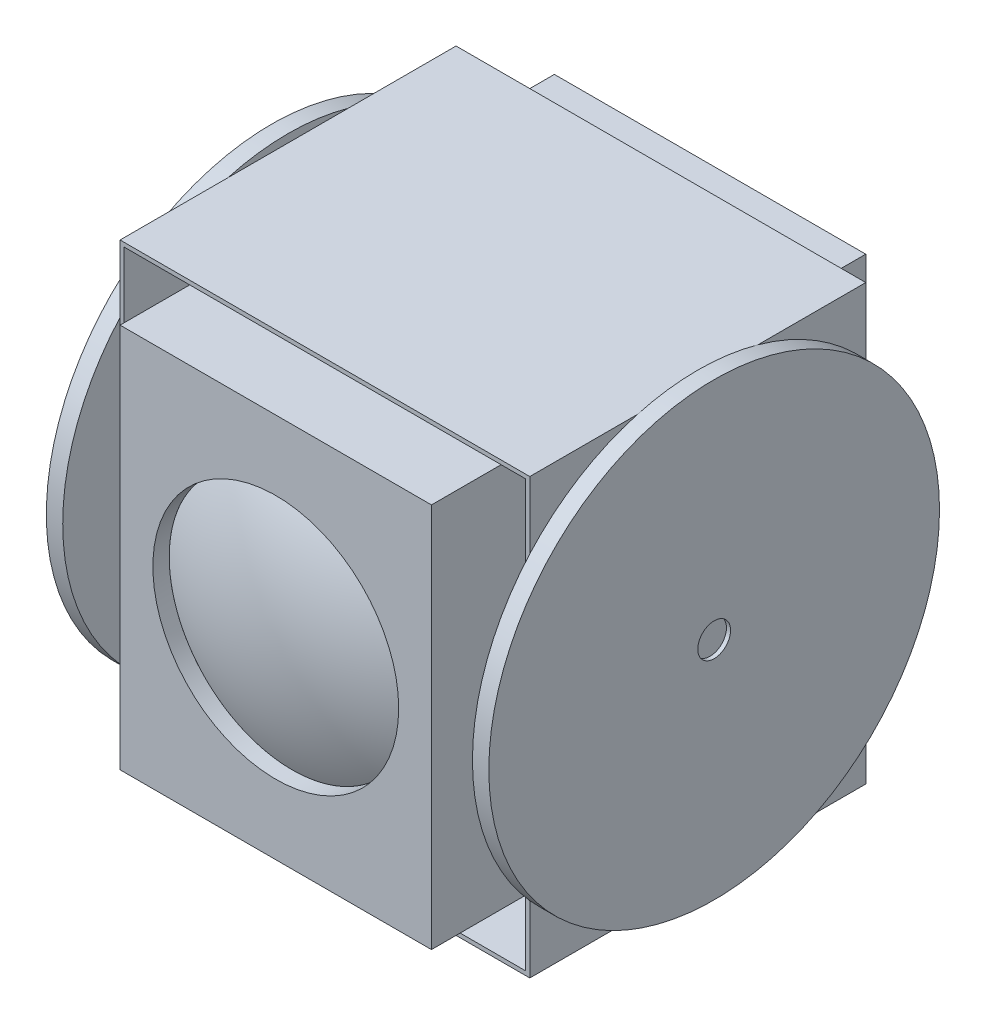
ISO-10303-21;
HEADER;
FILE_DESCRIPTION(('STEP AP214'),'2;1');
FILE_NAME('part.step','',(''),(''),'','','');
FILE_SCHEMA(('AUTOMOTIVE_DESIGN { 1 0 10303 214 1 1 1 1 }'));
ENDSEC;
DATA;
#1=APPLICATION_CONTEXT('core data for automotive mechanical design processes');
#2=APPLICATION_PROTOCOL_DEFINITION('international standard','automotive_design',2000,#1);
#3=PRODUCT_CONTEXT('',#1,'mechanical');
#4=PRODUCT('Part','Part','',(#3));
#5=PRODUCT_RELATED_PRODUCT_CATEGORY('part','',(#4));
#6=PRODUCT_DEFINITION_FORMATION('','',#4);
#7=PRODUCT_DEFINITION_CONTEXT('part definition',#1,'design');
#8=PRODUCT_DEFINITION('design','',#6,#7);
#9=PRODUCT_DEFINITION_SHAPE('','',#8);
#10=(LENGTH_UNIT() NAMED_UNIT(*) SI_UNIT(.MILLI.,.METRE.));
#11=(NAMED_UNIT(*) PLANE_ANGLE_UNIT() SI_UNIT($,.RADIAN.));
#12=(NAMED_UNIT(*) SI_UNIT($,.STERADIAN.) SOLID_ANGLE_UNIT());
#13=UNCERTAINTY_MEASURE_WITH_UNIT(LENGTH_MEASURE(1.E-05),#10,'distance_accuracy_value','');
#14=(GEOMETRIC_REPRESENTATION_CONTEXT(3) GLOBAL_UNCERTAINTY_ASSIGNED_CONTEXT((#13)) GLOBAL_UNIT_ASSIGNED_CONTEXT((#10,
#11,#12)) REPRESENTATION_CONTEXT('',''));
#15=CARTESIAN_POINT('',(0.,0.,0.));
#16=DIRECTION('',(0.,0.,1.));
#17=DIRECTION('',(1.,0.,0.));
#18=AXIS2_PLACEMENT_3D('',#15,#16,#17);
#19=CARTESIAN_POINT('',(-31.75,0.,31.115));
#20=DIRECTION('',(0.,0.,1.));
#21=DIRECTION('',(1.,0.,0.));
#22=AXIS2_PLACEMENT_3D('',#19,#20,#21);
#23=PLANE('',#22);
#24=CARTESIAN_POINT('',(-31.75,0.,31.115));
#25=DIRECTION('',(0.,0.,1.));
#26=DIRECTION('',(1.,0.,0.));
#27=AXIS2_PLACEMENT_3D('',#24,#25,#26);
#28=CIRCLE('',#27,19.05);
#29=CARTESIAN_POINT('',(-12.7,0.,31.115));
#30=VERTEX_POINT('',#29);
#31=EDGE_CURVE('E103',#30,#30,#28,.T.);
#32=ORIENTED_EDGE('',*,*,#31,.T.);
#33=EDGE_LOOP('',(#32));
#34=FACE_BOUND('',#33,.T.);
#35=CARTESIAN_POINT('',(-31.75,0.,31.115));
#36=DIRECTION('',(0.,0.,-1.));
#37=DIRECTION('',(-1.,0.,0.));
#38=AXIS2_PLACEMENT_3D('',#35,#36,#37);
#39=CIRCLE('',#38,19.0465448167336);
#40=CARTESIAN_POINT('',(-50.7965448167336,0.,31.1149999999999));
#41=VERTEX_POINT('',#40);
#42=EDGE_CURVE('E207',#41,#41,#39,.T.);
#43=ORIENTED_EDGE('',*,*,#42,.T.);
#44=EDGE_LOOP('',(#43));
#45=FACE_BOUND('',#44,.T.);
#46=ADVANCED_FACE('F45',(#34,#45),#23,.T.);
#47=CARTESIAN_POINT('',(-55.88,29.845,-118.033867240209));
#48=DIRECTION('',(-1.,0.,0.));
#49=DIRECTION('',(0.,-1.,0.));
#50=AXIS2_PLACEMENT_3D('',#47,#48,#49);
#51=PLANE('',#50);
#52=DIRECTION('',(0.,1.,0.));
#53=VECTOR('',#52,1.);
#54=CARTESIAN_POINT('',(-55.88,29.845,-33.655));
#55=LINE('',#54,#53);
#56=CARTESIAN_POINT('',(-55.88,-29.845,-33.655));
#57=VERTEX_POINT('',#56);
#58=CARTESIAN_POINT('',(-55.88,29.845,-33.655));
#59=VERTEX_POINT('',#58);
#60=EDGE_CURVE('E54',#57,#59,#55,.T.);
#61=ORIENTED_EDGE('',*,*,#60,.F.);
#62=DIRECTION('',(0.,0.,1.));
#63=VECTOR('',#62,1.);
#64=CARTESIAN_POINT('',(-55.88,-29.845,-118.033867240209));
#65=LINE('',#64,#63);
#66=CARTESIAN_POINT('',(-55.88,-29.845,33.655));
#67=VERTEX_POINT('',#66);
#68=EDGE_CURVE('E82',#57,#67,#65,.T.);
#69=ORIENTED_EDGE('',*,*,#68,.T.);
#70=DIRECTION('',(0.,-1.,0.));
#71=VECTOR('',#70,1.);
#72=CARTESIAN_POINT('',(-55.88,29.845,33.655));
#73=LINE('',#72,#71);
#74=CARTESIAN_POINT('',(-55.88,29.845,33.655));
#75=VERTEX_POINT('',#74);
#76=EDGE_CURVE('E86',#75,#67,#73,.T.);
#77=ORIENTED_EDGE('',*,*,#76,.F.);
#78=DIRECTION('',(0.,0.,1.));
#79=VECTOR('',#78,1.);
#80=CARTESIAN_POINT('',(-55.88,29.845,-118.033867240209));
#81=LINE('',#80,#79);
#82=EDGE_CURVE('E114',#59,#75,#81,.T.);
#83=ORIENTED_EDGE('',*,*,#82,.F.);
#84=EDGE_LOOP('',(#61,#69,#77,#83));
#85=FACE_BOUND('',#84,.T.);
#86=ADVANCED_FACE('F47',(#85),#51,.T.);
#87=CARTESIAN_POINT('',(-55.88,29.845,-118.033867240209));
#88=DIRECTION('',(0.,1.,0.));
#89=DIRECTION('',(0.,0.,1.));
#90=AXIS2_PLACEMENT_3D('',#87,#88,#89);
#91=PLANE('',#90);
#92=DIRECTION('',(1.,0.,0.));
#93=VECTOR('',#92,1.);
#94=CARTESIAN_POINT('',(-55.88,29.845,-33.655));
#95=LINE('',#94,#93);
#96=CARTESIAN_POINT('',(-7.62,29.845,-33.655));
#97=VERTEX_POINT('',#96);
#98=EDGE_CURVE('E60',#59,#97,#95,.T.);
#99=ORIENTED_EDGE('',*,*,#98,.F.);
#100=ORIENTED_EDGE('',*,*,#82,.T.);
#101=DIRECTION('',(-1.,0.,0.));
#102=VECTOR('',#101,1.);
#103=CARTESIAN_POINT('',(-55.88,29.845,33.655));
#104=LINE('',#103,#102);
#105=CARTESIAN_POINT('',(-7.62,29.845,33.655));
#106=VERTEX_POINT('',#105);
#107=EDGE_CURVE('E90',#106,#75,#104,.T.);
#108=ORIENTED_EDGE('',*,*,#107,.F.);
#109=DIRECTION('',(0.,0.,1.));
#110=VECTOR('',#109,1.);
#111=CARTESIAN_POINT('',(-7.62,29.845,-118.033867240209));
#112=LINE('',#111,#110);
#113=EDGE_CURVE('E118',#97,#106,#112,.T.);
#114=ORIENTED_EDGE('',*,*,#113,.F.);
#115=EDGE_LOOP('',(#99,#100,#108,#114));
#116=FACE_BOUND('',#115,.T.);
#117=ADVANCED_FACE('F124',(#116),#91,.T.);
#118=CARTESIAN_POINT('',(-7.62,29.845,-118.033867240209));
#119=DIRECTION('',(1.,0.,0.));
#120=DIRECTION('',(0.,1.,0.));
#121=AXIS2_PLACEMENT_3D('',#118,#119,#120);
#122=PLANE('',#121);
#123=DIRECTION('',(0.,-1.,0.));
#124=VECTOR('',#123,1.);
#125=CARTESIAN_POINT('',(-7.62,29.845,-33.655));
#126=LINE('',#125,#124);
#127=CARTESIAN_POINT('',(-7.61999999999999,-29.845,-33.655));
#128=VERTEX_POINT('',#127);
#129=EDGE_CURVE('E112',#97,#128,#126,.T.);
#130=ORIENTED_EDGE('',*,*,#129,.F.);
#131=ORIENTED_EDGE('',*,*,#113,.T.);
#132=DIRECTION('',(0.,1.,0.));
#133=VECTOR('',#132,1.);
#134=CARTESIAN_POINT('',(-7.62,29.845,33.655));
#135=LINE('',#134,#133);
#136=CARTESIAN_POINT('',(-7.61999999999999,-29.845,33.655));
#137=VERTEX_POINT('',#136);
#138=EDGE_CURVE('E98',#137,#106,#135,.T.);
#139=ORIENTED_EDGE('',*,*,#138,.F.);
#140=DIRECTION('',(0.,0.,1.));
#141=VECTOR('',#140,1.);
#142=CARTESIAN_POINT('',(-7.61999999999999,-29.845,-118.033867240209));
#143=LINE('',#142,#141);
#144=EDGE_CURVE('E89',#128,#137,#143,.T.);
#145=ORIENTED_EDGE('',*,*,#144,.F.);
#146=EDGE_LOOP('',(#130,#131,#139,#145));
#147=FACE_BOUND('',#146,.T.);
#148=ADVANCED_FACE('F122',(#147),#122,.T.);
#149=CARTESIAN_POINT('',(-55.88,-29.845,-118.033867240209));
#150=DIRECTION('',(0.,-1.,0.));
#151=DIRECTION('',(0.,0.,-1.));
#152=AXIS2_PLACEMENT_3D('',#149,#150,#151);
#153=PLANE('',#152);
#154=DIRECTION('',(-1.,0.,0.));
#155=VECTOR('',#154,1.);
#156=CARTESIAN_POINT('',(-55.88,-29.845,-33.655));
#157=LINE('',#156,#155);
#158=EDGE_CURVE('E12',#128,#57,#157,.T.);
#159=ORIENTED_EDGE('',*,*,#158,.F.);
#160=ORIENTED_EDGE('',*,*,#144,.T.);
#161=DIRECTION('',(1.,0.,0.));
#162=VECTOR('',#161,1.);
#163=CARTESIAN_POINT('',(-55.88,-29.845,33.655));
#164=LINE('',#163,#162);
#165=EDGE_CURVE('E92',#67,#137,#164,.T.);
#166=ORIENTED_EDGE('',*,*,#165,.F.);
#167=ORIENTED_EDGE('',*,*,#68,.F.);
#168=EDGE_LOOP('',(#159,#160,#166,#167));
#169=FACE_BOUND('',#168,.T.);
#170=ADVANCED_FACE('F93',(#169),#153,.T.);
#171=CARTESIAN_POINT('',(0.,33.655,-33.655));
#172=DIRECTION('',(0.,0.,1.));
#173=DIRECTION('',(1.,0.,0.));
#174=AXIS2_PLACEMENT_3D('',#171,#172,#173);
#175=PLANE('',#174);
#176=ORIENTED_EDGE('',*,*,#60,.T.);
#177=ORIENTED_EDGE('',*,*,#98,.T.);
#178=ORIENTED_EDGE('',*,*,#129,.T.);
#179=ORIENTED_EDGE('',*,*,#158,.T.);
#180=EDGE_LOOP('',(#176,#177,#178,#179));
#181=FACE_BOUND('',#180,.T.);
#182=ADVANCED_FACE('F147',(#181),#175,.F.);
#183=CARTESIAN_POINT('',(0.,0.,33.655));
#184=DIRECTION('',(0.,0.,1.));
#185=DIRECTION('',(1.,0.,0.));
#186=AXIS2_PLACEMENT_3D('',#183,#184,#185);
#187=PLANE('',#186);
#188=CARTESIAN_POINT('',(-31.75,0.,33.655));
#189=DIRECTION('',(0.,0.,1.));
#190=DIRECTION('',(1.,0.,0.));
#191=AXIS2_PLACEMENT_3D('',#188,#189,#190);
#192=CIRCLE('',#191,19.05);
#193=CARTESIAN_POINT('',(-12.7,0.,33.655));
#194=VERTEX_POINT('',#193);
#195=EDGE_CURVE('E106',#194,#194,#192,.T.);
#196=ORIENTED_EDGE('',*,*,#195,.F.);
#197=EDGE_LOOP('',(#196));
#198=FACE_BOUND('',#197,.T.);
#199=ORIENTED_EDGE('',*,*,#76,.T.);
#200=ORIENTED_EDGE('',*,*,#165,.T.);
#201=ORIENTED_EDGE('',*,*,#138,.T.);
#202=ORIENTED_EDGE('',*,*,#107,.T.);
#203=EDGE_LOOP('',(#199,#200,#201,#202));
#204=FACE_BOUND('',#203,.T.);
#205=ADVANCED_FACE('F101',(#198,#204),#187,.T.);
#206=CARTESIAN_POINT('',(-31.75,0.,31.115));
#207=DIRECTION('',(0.,0.,1.));
#208=DIRECTION('',(1.,0.,0.));
#209=AXIS2_PLACEMENT_3D('',#206,#207,#208);
#210=CYLINDRICAL_SURFACE('',#209,19.05);
#211=ORIENTED_EDGE('',*,*,#31,.F.);
#212=EDGE_LOOP('',(#211));
#213=FACE_BOUND('',#212,.T.);
#214=ORIENTED_EDGE('',*,*,#195,.T.);
#215=EDGE_LOOP('',(#214));
#216=FACE_BOUND('',#215,.T.);
#217=ADVANCED_FACE('F142',(#213,#216),#210,.F.);
#218=CARTESIAN_POINT('',(-31.75,0.,-7.63731000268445));
#219=DIRECTION('',(0.,0.,-1.));
#220=DIRECTION('',(1.,0.,0.));
#221=AXIS2_PLACEMENT_3D('',#218,#219,#220);
#222=SPHERICAL_SURFACE('',#221,43.18);
#223=ORIENTED_EDGE('',*,*,#42,.F.);
#224=EDGE_LOOP('',(#223));
#225=FACE_BOUND('',#224,.T.);
#226=ADVANCED_FACE('F141',(#225),#222,.T.);
#227=CLOSED_SHELL('',(#46,#86,#117,#148,#170,#182,#205,#217,#226));
#228=MANIFOLD_SOLID_BREP('B2',#227);
#229=CARTESIAN_POINT('',(0.,33.02,0.));
#230=DIRECTION('',(0.,1.,0.));
#231=DIRECTION('',(0.,0.,1.));
#232=AXIS2_PLACEMENT_3D('',#229,#230,#231);
#233=PLANE('',#232);
#234=DIRECTION('',(0.,0.,1.));
#235=VECTOR('',#234,1.);
#236=CARTESIAN_POINT('',(-62.865,33.02,-26.035));
#237=LINE('',#236,#235);
#238=CARTESIAN_POINT('',(-62.865,33.02,-26.035));
#239=VERTEX_POINT('',#238);
#240=CARTESIAN_POINT('',(-62.865,33.02,26.035));
#241=VERTEX_POINT('',#240);
#242=EDGE_CURVE('E234',#239,#241,#237,.T.);
#243=ORIENTED_EDGE('',*,*,#242,.F.);
#244=DIRECTION('',(-1.,0.,0.));
#245=VECTOR('',#244,1.);
#246=CARTESIAN_POINT('',(0.,33.02,-26.035));
#247=LINE('',#246,#245);
#248=CARTESIAN_POINT('',(-0.635,33.02,-26.035));
#249=VERTEX_POINT('',#248);
#250=EDGE_CURVE('E429',#249,#239,#247,.T.);
#251=ORIENTED_EDGE('',*,*,#250,.F.);
#252=DIRECTION('',(0.,0.,1.));
#253=VECTOR('',#252,1.);
#254=CARTESIAN_POINT('',(-0.635,33.02,-26.035));
#255=LINE('',#254,#253);
#256=CARTESIAN_POINT('',(-0.634999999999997,33.02,26.035));
#257=VERTEX_POINT('',#256);
#258=EDGE_CURVE('E393',#249,#257,#255,.T.);
#259=ORIENTED_EDGE('',*,*,#258,.T.);
#260=DIRECTION('',(1.,0.,0.));
#261=VECTOR('',#260,1.);
#262=CARTESIAN_POINT('',(-63.5,33.02,26.035));
#263=LINE('',#262,#261);
#264=EDGE_CURVE('E426',#241,#257,#263,.T.);
#265=ORIENTED_EDGE('',*,*,#264,.F.);
#266=EDGE_LOOP('',(#243,#251,#259,#265));
#267=FACE_BOUND('',#266,.T.);
#268=ADVANCED_FACE('F216',(#267),#233,.F.);
#269=CARTESIAN_POINT('',(0.,-33.02,0.));
#270=DIRECTION('',(0.,-1.,0.));
#271=DIRECTION('',(0.,0.,1.));
#272=AXIS2_PLACEMENT_3D('',#269,#270,#271);
#273=PLANE('',#272);
#274=DIRECTION('',(0.,0.,-1.));
#275=VECTOR('',#274,1.);
#276=CARTESIAN_POINT('',(-62.865,-33.02,26.035));
#277=LINE('',#276,#275);
#278=CARTESIAN_POINT('',(-62.865,-33.02,26.035));
#279=VERTEX_POINT('',#278);
#280=CARTESIAN_POINT('',(-62.865,-33.02,-26.035));
#281=VERTEX_POINT('',#280);
#282=EDGE_CURVE('E561',#279,#281,#277,.T.);
#283=ORIENTED_EDGE('',*,*,#282,.F.);
#284=DIRECTION('',(1.,0.,0.));
#285=VECTOR('',#284,1.);
#286=CARTESIAN_POINT('',(-63.5,-33.02,26.035));
#287=LINE('',#286,#285);
#288=CARTESIAN_POINT('',(-0.634999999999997,-33.02,26.035));
#289=VERTEX_POINT('',#288);
#290=EDGE_CURVE('E399',#279,#289,#287,.T.);
#291=ORIENTED_EDGE('',*,*,#290,.T.);
#292=DIRECTION('',(0.,0.,-1.));
#293=VECTOR('',#292,1.);
#294=CARTESIAN_POINT('',(-0.635,-33.02,26.035));
#295=LINE('',#294,#293);
#296=CARTESIAN_POINT('',(-0.635,-33.02,-26.035));
#297=VERTEX_POINT('',#296);
#298=EDGE_CURVE('E379',#289,#297,#295,.T.);
#299=ORIENTED_EDGE('',*,*,#298,.T.);
#300=DIRECTION('',(-1.,0.,0.));
#301=VECTOR('',#300,1.);
#302=CARTESIAN_POINT('',(0.,-33.02,-26.035));
#303=LINE('',#302,#301);
#304=EDGE_CURVE('E242',#297,#281,#303,.T.);
#305=ORIENTED_EDGE('',*,*,#304,.T.);
#306=EDGE_LOOP('',(#283,#291,#299,#305));
#307=FACE_BOUND('',#306,.T.);
#308=ADVANCED_FACE('F516',(#307),#273,.F.);
#309=CARTESIAN_POINT('',(-63.5,0.,0.));
#310=DIRECTION('',(-1.,0.,0.));
#311=DIRECTION('',(0.,0.,-1.));
#312=AXIS2_PLACEMENT_3D('',#309,#310,#311);
#313=PLANE('',#312);
#314=DIRECTION('',(0.,-1.,0.));
#315=VECTOR('',#314,1.);
#316=CARTESIAN_POINT('',(-63.5,33.02,26.035));
#317=LINE('',#316,#315);
#318=CARTESIAN_POINT('',(-63.5,23.2794845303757,26.035));
#319=VERTEX_POINT('',#318);
#320=CARTESIAN_POINT('',(-63.5,-23.2794845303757,26.035));
#321=VERTEX_POINT('',#320);
#322=EDGE_CURVE('E338',#319,#321,#317,.T.);
#323=ORIENTED_EDGE('',*,*,#322,.F.);
#324=CARTESIAN_POINT('',(-63.5,0.,0.));
#325=DIRECTION('',(1.,0.,0.));
#326=DIRECTION('',(0.,0.,-1.));
#327=AXIS2_PLACEMENT_3D('',#324,#325,#326);
#328=CIRCLE('',#327,34.925);
#329=EDGE_CURVE('E350',#319,#321,#328,.T.);
#330=ORIENTED_EDGE('',*,*,#329,.T.);
#331=EDGE_LOOP('',(#323,#330));
#332=FACE_BOUND('',#331,.T.);
#333=ADVANCED_FACE('F361',(#332),#313,.F.);
#334=DIRECTION('',(0.,1.,0.));
#335=VECTOR('',#334,1.);
#336=CARTESIAN_POINT('',(-63.5,-33.02,-26.035));
#337=LINE('',#336,#335);
#338=CARTESIAN_POINT('',(-63.5,-23.2794845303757,-26.035));
#339=VERTEX_POINT('',#338);
#340=CARTESIAN_POINT('',(-63.5,23.2794845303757,-26.035));
#341=VERTEX_POINT('',#340);
#342=EDGE_CURVE('E362',#339,#341,#337,.T.);
#343=ORIENTED_EDGE('',*,*,#342,.F.);
#344=EDGE_CURVE('E359',#339,#341,#328,.T.);
#345=ORIENTED_EDGE('',*,*,#344,.T.);
#346=EDGE_LOOP('',(#343,#345));
#347=FACE_BOUND('',#346,.T.);
#348=ADVANCED_FACE('F513',(#347),#313,.F.);
#349=CARTESIAN_POINT('',(0.,0.,0.));
#350=DIRECTION('',(1.,0.,0.));
#351=DIRECTION('',(0.,0.,-1.));
#352=AXIS2_PLACEMENT_3D('',#349,#350,#351);
#353=PLANE('',#352);
#354=CARTESIAN_POINT('',(0.,0.,0.));
#355=DIRECTION('',(1.,0.,0.));
#356=DIRECTION('',(0.,0.,-1.));
#357=AXIS2_PLACEMENT_3D('',#354,#355,#356);
#358=CIRCLE('',#357,34.925);
#359=CARTESIAN_POINT('',(0.,-23.2794845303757,-26.035));
#360=VERTEX_POINT('',#359);
#361=CARTESIAN_POINT('',(0.,23.2794845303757,-26.035));
#362=VERTEX_POINT('',#361);
#363=EDGE_CURVE('E443',#360,#362,#358,.T.);
#364=ORIENTED_EDGE('',*,*,#363,.F.);
#365=DIRECTION('',(0.,1.,0.));
#366=VECTOR('',#365,1.);
#367=CARTESIAN_POINT('',(0.,-33.02,-26.035));
#368=LINE('',#367,#366);
#369=EDGE_CURVE('E390',#360,#362,#368,.T.);
#370=ORIENTED_EDGE('',*,*,#369,.T.);
#371=EDGE_LOOP('',(#364,#370));
#372=FACE_BOUND('',#371,.T.);
#373=ADVANCED_FACE('F501',(#372),#353,.F.);
#374=CARTESIAN_POINT('',(-63.5,33.655,-26.035));
#375=DIRECTION('',(1.,0.,0.));
#376=DIRECTION('',(0.,0.,-1.));
#377=AXIS2_PLACEMENT_3D('',#374,#375,#376);
#378=PLANE('',#377);
#379=DIRECTION('',(0.,-1.,0.));
#380=VECTOR('',#379,1.);
#381=CARTESIAN_POINT('',(-63.5,33.655,-26.035));
#382=LINE('',#381,#380);
#383=CARTESIAN_POINT('',(-63.5,33.655,-26.035));
#384=VERTEX_POINT('',#383);
#385=EDGE_CURVE('E344',#384,#341,#382,.T.);
#386=ORIENTED_EDGE('',*,*,#385,.T.);
#387=CARTESIAN_POINT('',(-63.5,33.655,-9.33255592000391));
#388=VERTEX_POINT('',#387);
#389=EDGE_CURVE('E360',#341,#388,#328,.T.);
#390=ORIENTED_EDGE('',*,*,#389,.T.);
#391=DIRECTION('',(0.,0.,1.));
#392=VECTOR('',#391,1.);
#393=CARTESIAN_POINT('',(-63.5,33.655,-26.035));
#394=LINE('',#393,#392);
#395=EDGE_CURVE('E401',#384,#388,#394,.T.);
#396=ORIENTED_EDGE('',*,*,#395,.F.);
#397=EDGE_LOOP('',(#386,#390,#396));
#398=FACE_BOUND('',#397,.T.);
#399=ADVANCED_FACE('F512',(#398),#378,.F.);
#400=CARTESIAN_POINT('',(-63.5,-33.655,-26.035));
#401=DIRECTION('',(-1.,0.,0.));
#402=DIRECTION('',(0.,0.,1.));
#403=AXIS2_PLACEMENT_3D('',#400,#401,#402);
#404=PLANE('',#403);
#405=DIRECTION('',(0.,1.,0.));
#406=VECTOR('',#405,1.);
#407=CARTESIAN_POINT('',(-63.5,-33.655,26.035));
#408=LINE('',#407,#406);
#409=CARTESIAN_POINT('',(-63.5,-33.655,26.035));
#410=VERTEX_POINT('',#409);
#411=EDGE_CURVE('E491',#410,#321,#408,.T.);
#412=ORIENTED_EDGE('',*,*,#411,.T.);
#413=CARTESIAN_POINT('',(-63.5,-33.655,9.33255592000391));
#414=VERTEX_POINT('',#413);
#415=EDGE_CURVE('E43',#321,#414,#328,.T.);
#416=ORIENTED_EDGE('',*,*,#415,.T.);
#417=DIRECTION('',(0.,0.,1.));
#418=VECTOR('',#417,1.);
#419=CARTESIAN_POINT('',(-63.5,-33.655,-26.035));
#420=LINE('',#419,#418);
#421=EDGE_CURVE('E482',#414,#410,#420,.T.);
#422=ORIENTED_EDGE('',*,*,#421,.T.);
#423=EDGE_LOOP('',(#412,#416,#422));
#424=FACE_BOUND('',#423,.T.);
#425=ADVANCED_FACE('F508',(#424),#404,.T.);
#426=CARTESIAN_POINT('',(-63.5,-33.655,-26.035));
#427=VERTEX_POINT('',#426);
#428=CARTESIAN_POINT('',(-63.5,-33.655,-9.33255592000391));
#429=VERTEX_POINT('',#428);
#430=EDGE_CURVE('E483',#427,#429,#420,.T.);
#431=ORIENTED_EDGE('',*,*,#430,.T.);
#432=EDGE_CURVE('E225',#429,#339,#328,.T.);
#433=ORIENTED_EDGE('',*,*,#432,.T.);
#434=DIRECTION('',(0.,1.,0.));
#435=VECTOR('',#434,1.);
#436=CARTESIAN_POINT('',(-63.5,-33.655,-26.035));
#437=LINE('',#436,#435);
#438=EDGE_CURVE('E489',#427,#339,#437,.T.);
#439=ORIENTED_EDGE('',*,*,#438,.F.);
#440=EDGE_LOOP('',(#431,#433,#439));
#441=FACE_BOUND('',#440,.T.);
#442=ADVANCED_FACE('F500',(#441),#404,.T.);
#443=CARTESIAN_POINT('',(0.,23.2794845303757,26.035));
#444=VERTEX_POINT('',#443);
#445=CARTESIAN_POINT('',(0.,-23.2794845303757,26.035));
#446=VERTEX_POINT('',#445);
#447=EDGE_CURVE('E451',#444,#446,#358,.T.);
#448=ORIENTED_EDGE('',*,*,#447,.F.);
#449=DIRECTION('',(0.,-1.,0.));
#450=VECTOR('',#449,1.);
#451=CARTESIAN_POINT('',(0.,33.02,26.035));
#452=LINE('',#451,#450);
#453=EDGE_CURVE('E387',#444,#446,#452,.T.);
#454=ORIENTED_EDGE('',*,*,#453,.T.);
#455=EDGE_LOOP('',(#448,#454));
#456=FACE_BOUND('',#455,.T.);
#457=ADVANCED_FACE('F497',(#456),#353,.F.);
#458=DIRECTION('',(0.,0.,-1.));
#459=VECTOR('',#458,1.);
#460=CARTESIAN_POINT('',(0.,33.655,26.035));
#461=LINE('',#460,#459);
#462=CARTESIAN_POINT('',(0.,33.655,9.33255592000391));
#463=VERTEX_POINT('',#462);
#464=CARTESIAN_POINT('',(0.,33.655,-9.33255592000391));
#465=VERTEX_POINT('',#464);
#466=EDGE_CURVE('E409',#463,#465,#461,.T.);
#467=ORIENTED_EDGE('',*,*,#466,.F.);
#468=EDGE_CURVE('E444',#465,#463,#358,.T.);
#469=ORIENTED_EDGE('',*,*,#468,.F.);
#470=EDGE_LOOP('',(#467,#469));
#471=FACE_BOUND('',#470,.T.);
#472=ADVANCED_FACE('F499',(#471),#353,.F.);
#473=CARTESIAN_POINT('',(2.54,0.,0.));
#474=DIRECTION('',(-1.,0.,0.));
#475=DIRECTION('',(0.,0.,1.));
#476=AXIS2_PLACEMENT_3D('',#473,#474,#475);
#477=CYLINDRICAL_SURFACE('',#476,34.925);
#478=CARTESIAN_POINT('',(2.54,0.,0.));
#479=DIRECTION('',(1.,0.,0.));
#480=DIRECTION('',(0.,0.,-1.));
#481=AXIS2_PLACEMENT_3D('',#478,#479,#480);
#482=CIRCLE('',#481,34.925);
#483=CARTESIAN_POINT('',(2.54,0.,-34.925));
#484=VERTEX_POINT('',#483);
#485=EDGE_CURVE('E414',#484,#484,#482,.T.);
#486=ORIENTED_EDGE('',*,*,#485,.F.);
#487=EDGE_LOOP('',(#486));
#488=FACE_BOUND('',#487,.T.);
#489=EDGE_CURVE('E421',#362,#465,#358,.T.);
#490=ORIENTED_EDGE('',*,*,#489,.T.);
#491=ORIENTED_EDGE('',*,*,#468,.T.);
#492=EDGE_CURVE('E449',#463,#444,#358,.T.);
#493=ORIENTED_EDGE('',*,*,#492,.T.);
#494=ORIENTED_EDGE('',*,*,#447,.T.);
#495=CARTESIAN_POINT('',(0.,-33.655,9.33255592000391));
#496=VERTEX_POINT('',#495);
#497=EDGE_CURVE('E455',#446,#496,#358,.T.);
#498=ORIENTED_EDGE('',*,*,#497,.T.);
#499=CARTESIAN_POINT('',(0.,-33.655,-9.33255592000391));
#500=VERTEX_POINT('',#499);
#501=EDGE_CURVE('E453',#496,#500,#358,.T.);
#502=ORIENTED_EDGE('',*,*,#501,.T.);
#503=EDGE_CURVE('E450',#500,#360,#358,.T.);
#504=ORIENTED_EDGE('',*,*,#503,.T.);
#505=ORIENTED_EDGE('',*,*,#363,.T.);
#506=EDGE_LOOP('',(#490,#491,#493,#494,#498,#502,#504,#505));
#507=FACE_BOUND('',#506,.T.);
#508=ADVANCED_FACE('F218',(#488,#507),#477,.T.);
#509=CARTESIAN_POINT('',(2.54,0.,0.));
#510=DIRECTION('',(1.,0.,0.));
#511=DIRECTION('',(0.,0.,-1.));
#512=AXIS2_PLACEMENT_3D('',#509,#510,#511);
#513=PLANE('',#512);
#514=CARTESIAN_POINT('',(2.54,0.,0.));
#515=DIRECTION('',(1.,0.,0.));
#516=DIRECTION('',(0.,0.,-1.));
#517=AXIS2_PLACEMENT_3D('',#514,#515,#516);
#518=CIRCLE('',#517,2.54);
#519=CARTESIAN_POINT('',(2.54,0.,-2.54));
#520=VERTEX_POINT('',#519);
#521=EDGE_CURVE('E549',#520,#520,#518,.T.);
#522=ORIENTED_EDGE('',*,*,#521,.F.);
#523=EDGE_LOOP('',(#522));
#524=FACE_BOUND('',#523,.T.);
#525=ORIENTED_EDGE('',*,*,#485,.T.);
#526=EDGE_LOOP('',(#525));
#527=FACE_BOUND('',#526,.T.);
#528=ADVANCED_FACE('F538',(#524,#527),#513,.T.);
#529=ORIENTED_EDGE('',*,*,#501,.F.);
#530=DIRECTION('',(0.,0.,-1.));
#531=VECTOR('',#530,1.);
#532=CARTESIAN_POINT('',(0.,-33.655,0.));
#533=LINE('',#532,#531);
#534=EDGE_CURVE('E220',#496,#500,#533,.T.);
#535=ORIENTED_EDGE('',*,*,#534,.T.);
#536=EDGE_LOOP('',(#529,#535));
#537=FACE_BOUND('',#536,.T.);
#538=ADVANCED_FACE('F507',(#537),#353,.F.);
#539=CARTESIAN_POINT('',(0.,33.655,26.035));
#540=DIRECTION('',(-1.,0.,0.));
#541=DIRECTION('',(0.,0.,1.));
#542=AXIS2_PLACEMENT_3D('',#539,#540,#541);
#543=PLANE('',#542);
#544=ORIENTED_EDGE('',*,*,#489,.F.);
#545=DIRECTION('',(0.,-1.,0.));
#546=VECTOR('',#545,1.);
#547=CARTESIAN_POINT('',(0.,33.655,-26.035));
#548=LINE('',#547,#546);
#549=CARTESIAN_POINT('',(0.,33.655,-26.035));
#550=VERTEX_POINT('',#549);
#551=EDGE_CURVE('E441',#550,#362,#548,.T.);
#552=ORIENTED_EDGE('',*,*,#551,.F.);
#553=EDGE_CURVE('E417',#465,#550,#461,.T.);
#554=ORIENTED_EDGE('',*,*,#553,.F.);
#555=EDGE_LOOP('',(#544,#552,#554));
#556=FACE_BOUND('',#555,.T.);
#557=ADVANCED_FACE('F536',(#556),#543,.F.);
#558=ORIENTED_EDGE('',*,*,#492,.F.);
#559=CARTESIAN_POINT('',(0.,33.655,26.035));
#560=VERTEX_POINT('',#559);
#561=EDGE_CURVE('E416',#560,#463,#461,.T.);
#562=ORIENTED_EDGE('',*,*,#561,.F.);
#563=DIRECTION('',(0.,-1.,0.));
#564=VECTOR('',#563,1.);
#565=CARTESIAN_POINT('',(0.,33.655,26.035));
#566=LINE('',#565,#564);
#567=EDGE_CURVE('E345',#560,#444,#566,.T.);
#568=ORIENTED_EDGE('',*,*,#567,.T.);
#569=EDGE_LOOP('',(#558,#562,#568));
#570=FACE_BOUND('',#569,.T.);
#571=ADVANCED_FACE('F533',(#570),#543,.F.);
#572=CARTESIAN_POINT('',(0.,33.655,-26.035));
#573=DIRECTION('',(0.,0.,1.));
#574=DIRECTION('',(1.,0.,0.));
#575=AXIS2_PLACEMENT_3D('',#572,#573,#574);
#576=PLANE('',#575);
#577=ORIENTED_EDGE('',*,*,#342,.T.);
#578=ORIENTED_EDGE('',*,*,#385,.F.);
#579=DIRECTION('',(-1.,0.,0.));
#580=VECTOR('',#579,1.);
#581=CARTESIAN_POINT('',(0.,33.655,-26.035));
#582=LINE('',#581,#580);
#583=EDGE_CURVE('E425',#550,#384,#582,.T.);
#584=ORIENTED_EDGE('',*,*,#583,.F.);
#585=ORIENTED_EDGE('',*,*,#551,.T.);
#586=ORIENTED_EDGE('',*,*,#369,.F.);
#587=DIRECTION('',(0.,1.,0.));
#588=VECTOR('',#587,1.);
#589=CARTESIAN_POINT('',(0.,-33.655,-26.035));
#590=LINE('',#589,#588);
#591=CARTESIAN_POINT('',(0.,-33.655,-26.035));
#592=VERTEX_POINT('',#591);
#593=EDGE_CURVE('E467',#592,#360,#590,.T.);
#594=ORIENTED_EDGE('',*,*,#593,.F.);
#595=DIRECTION('',(-1.,0.,0.));
#596=VECTOR('',#595,1.);
#597=CARTESIAN_POINT('',(0.,-33.655,-26.035));
#598=LINE('',#597,#596);
#599=EDGE_CURVE('E475',#592,#427,#598,.T.);
#600=ORIENTED_EDGE('',*,*,#599,.T.);
#601=ORIENTED_EDGE('',*,*,#438,.T.);
#602=EDGE_LOOP('',(#577,#578,#584,#585,#586,#594,#600,#601));
#603=FACE_BOUND('',#602,.T.);
#604=ORIENTED_EDGE('',*,*,#250,.T.);
#605=DIRECTION('',(0.,1.,0.));
#606=VECTOR('',#605,1.);
#607=CARTESIAN_POINT('',(-62.865,-33.02,-26.035));
#608=LINE('',#607,#606);
#609=EDGE_CURVE('E558',#281,#239,#608,.T.);
#610=ORIENTED_EDGE('',*,*,#609,.F.);
#611=ORIENTED_EDGE('',*,*,#304,.F.);
#612=DIRECTION('',(0.,1.,0.));
#613=VECTOR('',#612,1.);
#614=CARTESIAN_POINT('',(-0.635,-33.02,-26.035));
#615=LINE('',#614,#613);
#616=EDGE_CURVE('E373',#297,#249,#615,.T.);
#617=ORIENTED_EDGE('',*,*,#616,.T.);
#618=EDGE_LOOP('',(#604,#610,#611,#617));
#619=FACE_BOUND('',#618,.T.);
#620=ADVANCED_FACE('F530',(#603,#619),#576,.F.);
#621=CARTESIAN_POINT('',(-63.5,33.655,9.33255592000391));
#622=VERTEX_POINT('',#621);
#623=CARTESIAN_POINT('',(-63.5,33.655,26.035));
#624=VERTEX_POINT('',#623);
#625=EDGE_CURVE('E365',#622,#624,#394,.T.);
#626=ORIENTED_EDGE('',*,*,#625,.F.);
#627=EDGE_CURVE('E354',#622,#319,#328,.T.);
#628=ORIENTED_EDGE('',*,*,#627,.T.);
#629=DIRECTION('',(0.,-1.,0.));
#630=VECTOR('',#629,1.);
#631=CARTESIAN_POINT('',(-63.5,33.655,26.035));
#632=LINE('',#631,#630);
#633=EDGE_CURVE('E333',#624,#319,#632,.T.);
#634=ORIENTED_EDGE('',*,*,#633,.F.);
#635=EDGE_LOOP('',(#626,#628,#634));
#636=FACE_BOUND('',#635,.T.);
#637=ADVANCED_FACE('F364',(#636),#378,.F.);
#638=CARTESIAN_POINT('',(-63.5,33.655,26.035));
#639=DIRECTION('',(0.,0.,-1.));
#640=DIRECTION('',(-1.,0.,0.));
#641=AXIS2_PLACEMENT_3D('',#638,#639,#640);
#642=PLANE('',#641);
#643=DIRECTION('',(0.,-1.,0.));
#644=VECTOR('',#643,1.);
#645=CARTESIAN_POINT('',(-62.865,33.02,26.035));
#646=LINE('',#645,#644);
#647=EDGE_CURVE('E391',#241,#279,#646,.T.);
#648=ORIENTED_EDGE('',*,*,#647,.F.);
#649=ORIENTED_EDGE('',*,*,#264,.T.);
#650=DIRECTION('',(0.,-1.,0.));
#651=VECTOR('',#650,1.);
#652=CARTESIAN_POINT('',(-0.635,33.02,26.035));
#653=LINE('',#652,#651);
#654=EDGE_CURVE('E383',#257,#289,#653,.T.);
#655=ORIENTED_EDGE('',*,*,#654,.T.);
#656=ORIENTED_EDGE('',*,*,#290,.F.);
#657=EDGE_LOOP('',(#648,#649,#655,#656));
#658=FACE_BOUND('',#657,.T.);
#659=ORIENTED_EDGE('',*,*,#633,.T.);
#660=ORIENTED_EDGE('',*,*,#322,.T.);
#661=ORIENTED_EDGE('',*,*,#411,.F.);
#662=DIRECTION('',(1.,0.,0.));
#663=VECTOR('',#662,1.);
#664=CARTESIAN_POINT('',(-63.5,-33.655,26.035));
#665=LINE('',#664,#663);
#666=CARTESIAN_POINT('',(0.,-33.655,26.035));
#667=VERTEX_POINT('',#666);
#668=EDGE_CURVE('E477',#410,#667,#665,.T.);
#669=ORIENTED_EDGE('',*,*,#668,.T.);
#670=DIRECTION('',(0.,1.,0.));
#671=VECTOR('',#670,1.);
#672=CARTESIAN_POINT('',(0.,-33.655,26.035));
#673=LINE('',#672,#671);
#674=EDGE_CURVE('E435',#667,#446,#673,.T.);
#675=ORIENTED_EDGE('',*,*,#674,.T.);
#676=ORIENTED_EDGE('',*,*,#453,.F.);
#677=ORIENTED_EDGE('',*,*,#567,.F.);
#678=DIRECTION('',(1.,0.,0.));
#679=VECTOR('',#678,1.);
#680=CARTESIAN_POINT('',(-63.5,33.655,26.035));
#681=LINE('',#680,#679);
#682=EDGE_CURVE('E340',#624,#560,#681,.T.);
#683=ORIENTED_EDGE('',*,*,#682,.F.);
#684=EDGE_LOOP('',(#659,#660,#661,#669,#675,#676,#677,#683));
#685=FACE_BOUND('',#684,.T.);
#686=ADVANCED_FACE('F335',(#658,#685),#642,.F.);
#687=CARTESIAN_POINT('',(0.,33.655,0.));
#688=DIRECTION('',(0.,1.,0.));
#689=DIRECTION('',(0.,0.,1.));
#690=AXIS2_PLACEMENT_3D('',#687,#688,#689);
#691=PLANE('',#690);
#692=ORIENTED_EDGE('',*,*,#561,.T.);
#693=ORIENTED_EDGE('',*,*,#466,.T.);
#694=ORIENTED_EDGE('',*,*,#553,.T.);
#695=ORIENTED_EDGE('',*,*,#583,.T.);
#696=ORIENTED_EDGE('',*,*,#395,.T.);
#697=EDGE_CURVE('E396',#388,#622,#394,.T.);
#698=ORIENTED_EDGE('',*,*,#697,.T.);
#699=ORIENTED_EDGE('',*,*,#625,.T.);
#700=ORIENTED_EDGE('',*,*,#682,.T.);
#701=EDGE_LOOP('',(#692,#693,#694,#695,#696,#698,#699,#700));
#702=FACE_BOUND('',#701,.T.);
#703=ADVANCED_FACE('F524',(#702),#691,.T.);
#704=CARTESIAN_POINT('',(0.,-33.655,26.035));
#705=DIRECTION('',(1.,0.,0.));
#706=DIRECTION('',(0.,0.,-1.));
#707=AXIS2_PLACEMENT_3D('',#704,#705,#706);
#708=PLANE('',#707);
#709=ORIENTED_EDGE('',*,*,#497,.F.);
#710=ORIENTED_EDGE('',*,*,#674,.F.);
#711=DIRECTION('',(0.,0.,-1.));
#712=VECTOR('',#711,1.);
#713=CARTESIAN_POINT('',(0.,-33.655,26.035));
#714=LINE('',#713,#712);
#715=EDGE_CURVE('E476',#667,#496,#714,.T.);
#716=ORIENTED_EDGE('',*,*,#715,.T.);
#717=EDGE_LOOP('',(#709,#710,#716));
#718=FACE_BOUND('',#717,.T.);
#719=ADVANCED_FACE('F495',(#718),#708,.T.);
#720=ORIENTED_EDGE('',*,*,#503,.F.);
#721=EDGE_CURVE('E465',#500,#592,#714,.T.);
#722=ORIENTED_EDGE('',*,*,#721,.T.);
#723=ORIENTED_EDGE('',*,*,#593,.T.);
#724=EDGE_LOOP('',(#720,#722,#723));
#725=FACE_BOUND('',#724,.T.);
#726=ADVANCED_FACE('F464',(#725),#708,.T.);
#727=CARTESIAN_POINT('',(0.,-33.655,0.));
#728=DIRECTION('',(0.,-1.,0.));
#729=DIRECTION('',(0.,0.,1.));
#730=AXIS2_PLACEMENT_3D('',#727,#728,#729);
#731=PLANE('',#730);
#732=ORIENTED_EDGE('',*,*,#715,.F.);
#733=ORIENTED_EDGE('',*,*,#668,.F.);
#734=ORIENTED_EDGE('',*,*,#421,.F.);
#735=EDGE_CURVE('E485',#429,#414,#420,.T.);
#736=ORIENTED_EDGE('',*,*,#735,.F.);
#737=ORIENTED_EDGE('',*,*,#430,.F.);
#738=ORIENTED_EDGE('',*,*,#599,.F.);
#739=ORIENTED_EDGE('',*,*,#721,.F.);
#740=ORIENTED_EDGE('',*,*,#534,.F.);
#741=EDGE_LOOP('',(#732,#733,#734,#736,#737,#738,#739,#740));
#742=FACE_BOUND('',#741,.T.);
#743=ADVANCED_FACE('F471',(#742),#731,.T.);
#744=EDGE_CURVE('E358',#414,#429,#328,.T.);
#745=ORIENTED_EDGE('',*,*,#744,.T.);
#746=ORIENTED_EDGE('',*,*,#735,.T.);
#747=EDGE_LOOP('',(#745,#746));
#748=FACE_BOUND('',#747,.T.);
#749=ADVANCED_FACE('F596',(#748),#313,.F.);
#750=CARTESIAN_POINT('',(-66.04,0.,0.));
#751=DIRECTION('',(1.,0.,0.));
#752=DIRECTION('',(0.,0.,-1.));
#753=AXIS2_PLACEMENT_3D('',#750,#751,#752);
#754=CYLINDRICAL_SURFACE('',#753,34.925);
#755=CARTESIAN_POINT('',(-66.04,0.,0.));
#756=DIRECTION('',(1.,0.,0.));
#757=DIRECTION('',(0.,0.,-1.));
#758=AXIS2_PLACEMENT_3D('',#755,#756,#757);
#759=CIRCLE('',#758,34.925);
#760=CARTESIAN_POINT('',(-66.04,0.,-34.925));
#761=VERTEX_POINT('',#760);
#762=EDGE_CURVE('E394',#761,#761,#759,.T.);
#763=ORIENTED_EDGE('',*,*,#762,.T.);
#764=EDGE_LOOP('',(#763));
#765=FACE_BOUND('',#764,.T.);
#766=ORIENTED_EDGE('',*,*,#389,.F.);
#767=ORIENTED_EDGE('',*,*,#344,.F.);
#768=ORIENTED_EDGE('',*,*,#432,.F.);
#769=ORIENTED_EDGE('',*,*,#744,.F.);
#770=ORIENTED_EDGE('',*,*,#415,.F.);
#771=ORIENTED_EDGE('',*,*,#329,.F.);
#772=ORIENTED_EDGE('',*,*,#627,.F.);
#773=EDGE_CURVE('E227',#388,#622,#328,.T.);
#774=ORIENTED_EDGE('',*,*,#773,.F.);
#775=EDGE_LOOP('',(#766,#767,#768,#769,#770,#771,#772,#774));
#776=FACE_BOUND('',#775,.T.);
#777=ADVANCED_FACE('F352',(#765,#776),#754,.T.);
#778=CARTESIAN_POINT('',(-66.04,0.,0.));
#779=DIRECTION('',(-1.,0.,0.));
#780=DIRECTION('',(0.,0.,-1.));
#781=AXIS2_PLACEMENT_3D('',#778,#779,#780);
#782=PLANE('',#781);
#783=ORIENTED_EDGE('',*,*,#762,.F.);
#784=EDGE_LOOP('',(#783));
#785=FACE_BOUND('',#784,.T.);
#786=ADVANCED_FACE('F589',(#785),#782,.T.);
#787=ORIENTED_EDGE('',*,*,#697,.F.);
#788=ORIENTED_EDGE('',*,*,#773,.T.);
#789=EDGE_LOOP('',(#787,#788));
#790=FACE_BOUND('',#789,.T.);
#791=ADVANCED_FACE('F585',(#790),#313,.F.);
#792=CARTESIAN_POINT('',(-0.635,0.,0.));
#793=DIRECTION('',(1.,0.,0.));
#794=DIRECTION('',(0.,0.,-1.));
#795=AXIS2_PLACEMENT_3D('',#792,#793,#794);
#796=PLANE('',#795);
#797=ORIENTED_EDGE('',*,*,#258,.F.);
#798=ORIENTED_EDGE('',*,*,#616,.F.);
#799=ORIENTED_EDGE('',*,*,#298,.F.);
#800=ORIENTED_EDGE('',*,*,#654,.F.);
#801=EDGE_LOOP('',(#797,#798,#799,#800));
#802=FACE_BOUND('',#801,.T.);
#803=ADVANCED_FACE('F571',(#802),#796,.F.);
#804=CARTESIAN_POINT('',(-62.865,0.,0.));
#805=DIRECTION('',(-1.,0.,0.));
#806=DIRECTION('',(0.,0.,-1.));
#807=AXIS2_PLACEMENT_3D('',#804,#805,#806);
#808=PLANE('',#807);
#809=ORIENTED_EDGE('',*,*,#242,.T.);
#810=ORIENTED_EDGE('',*,*,#647,.T.);
#811=ORIENTED_EDGE('',*,*,#282,.T.);
#812=ORIENTED_EDGE('',*,*,#609,.T.);
#813=EDGE_LOOP('',(#809,#810,#811,#812));
#814=FACE_BOUND('',#813,.T.);
#815=ADVANCED_FACE('F574',(#814),#808,.F.);
#816=CARTESIAN_POINT('',(1.905,0.,0.));
#817=DIRECTION('',(1.,0.,0.));
#818=DIRECTION('',(0.,0.,-1.));
#819=AXIS2_PLACEMENT_3D('',#816,#817,#818);
#820=CYLINDRICAL_SURFACE('',#819,2.54);
#821=CARTESIAN_POINT('',(1.905,0.,0.));
#822=DIRECTION('',(1.,0.,0.));
#823=DIRECTION('',(0.,0.,-1.));
#824=AXIS2_PLACEMENT_3D('',#821,#822,#823);
#825=CIRCLE('',#824,2.54);
#826=CARTESIAN_POINT('',(1.905,0.,-2.54));
#827=VERTEX_POINT('',#826);
#828=EDGE_CURVE('E552',#827,#827,#825,.T.);
#829=ORIENTED_EDGE('',*,*,#828,.F.);
#830=EDGE_LOOP('',(#829));
#831=FACE_BOUND('',#830,.T.);
#832=ORIENTED_EDGE('',*,*,#521,.T.);
#833=EDGE_LOOP('',(#832));
#834=FACE_BOUND('',#833,.T.);
#835=ADVANCED_FACE('F576',(#831,#834),#820,.F.);
#836=CARTESIAN_POINT('',(1.905,0.,0.));
#837=DIRECTION('',(1.,0.,0.));
#838=DIRECTION('',(0.,0.,-1.));
#839=AXIS2_PLACEMENT_3D('',#836,#837,#838);
#840=PLANE('',#839);
#841=ORIENTED_EDGE('',*,*,#828,.T.);
#842=EDGE_LOOP('',(#841));
#843=FACE_BOUND('',#842,.T.);
#844=ADVANCED_FACE('F582',(#843),#840,.T.);
#845=CLOSED_SHELL('',(#268,#308,#333,#348,#373,#399,#425,#442,#457,#472,#508,#528,#538,#557,
#571,#620,#637,#686,#703,#719,#726,#743,#749,#777,#786,#791,#803,#815,#835,#844));
#846=MANIFOLD_SOLID_BREP('B6',#845);
#847=ADVANCED_BREP_SHAPE_REPRESENTATION('',(#18,#228,#846),#14);
#848=SHAPE_DEFINITION_REPRESENTATION(#9,#847);
ENDSEC;
END-ISO-10303-21;
